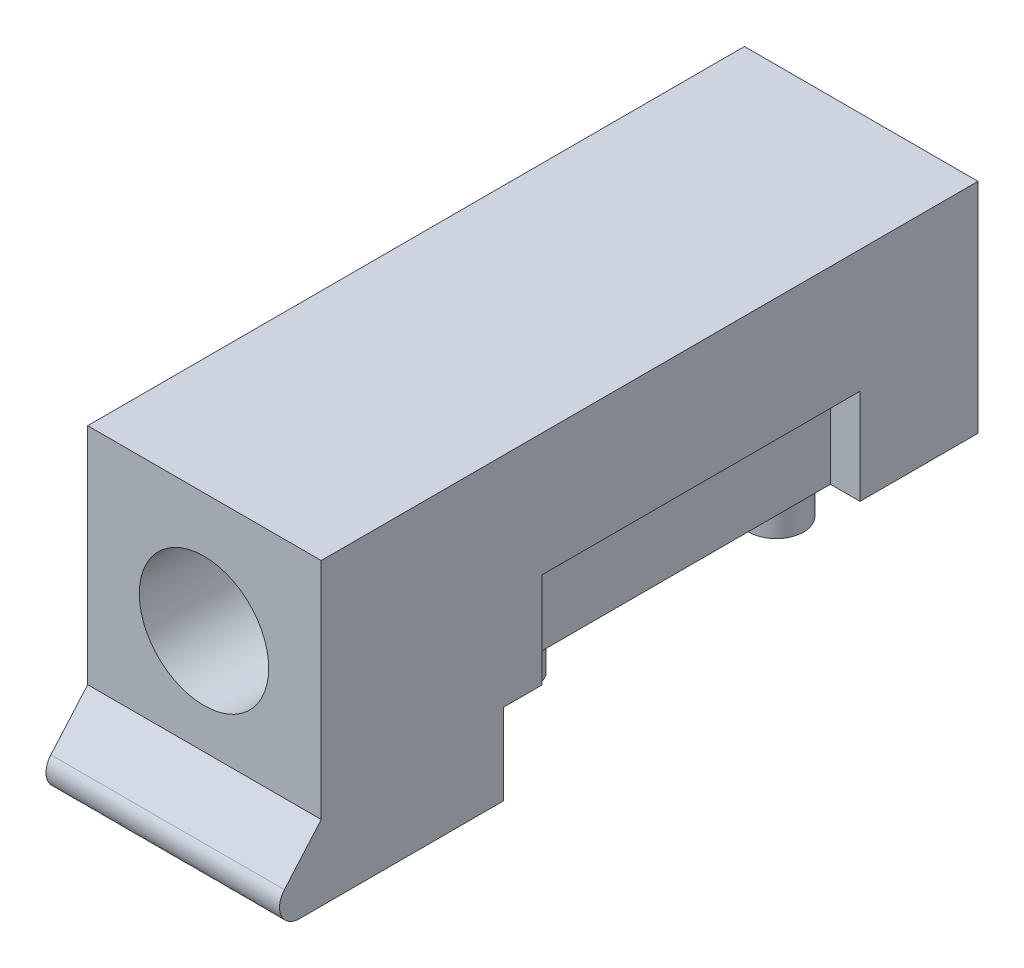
ISO-10303-21;
HEADER;
FILE_DESCRIPTION(('STEP AP214'),'2;1');
FILE_NAME('part.step','',(''),(''),'','','');
FILE_SCHEMA(('AUTOMOTIVE_DESIGN { 1 0 10303 214 1 1 1 1 }'));
ENDSEC;
DATA;
#1=APPLICATION_CONTEXT('core data for automotive mechanical design processes');
#2=APPLICATION_PROTOCOL_DEFINITION('international standard','automotive_design',2000,#1);
#3=PRODUCT_CONTEXT('',#1,'mechanical');
#4=PRODUCT('Part','Part','',(#3));
#5=PRODUCT_RELATED_PRODUCT_CATEGORY('part','',(#4));
#6=PRODUCT_DEFINITION_FORMATION('','',#4);
#7=PRODUCT_DEFINITION_CONTEXT('part definition',#1,'design');
#8=PRODUCT_DEFINITION('design','',#6,#7);
#9=PRODUCT_DEFINITION_SHAPE('','',#8);
#10=(LENGTH_UNIT() NAMED_UNIT(*) SI_UNIT(.MILLI.,.METRE.));
#11=(NAMED_UNIT(*) PLANE_ANGLE_UNIT() SI_UNIT($,.RADIAN.));
#12=(NAMED_UNIT(*) SI_UNIT($,.STERADIAN.) SOLID_ANGLE_UNIT());
#13=UNCERTAINTY_MEASURE_WITH_UNIT(LENGTH_MEASURE(1.E-05),#10,'distance_accuracy_value','');
#14=(GEOMETRIC_REPRESENTATION_CONTEXT(3) GLOBAL_UNCERTAINTY_ASSIGNED_CONTEXT((#13)) GLOBAL_UNIT_ASSIGNED_CONTEXT((#10,
#11,#12)) REPRESENTATION_CONTEXT('',''));
#15=CARTESIAN_POINT('',(0.,0.,0.));
#16=DIRECTION('',(0.,0.,1.));
#17=DIRECTION('',(1.,0.,0.));
#18=AXIS2_PLACEMENT_3D('',#15,#16,#17);
#19=CARTESIAN_POINT('',(-5.518,0.,-62.0626));
#20=DIRECTION('',(0.,1.,0.));
#21=DIRECTION('',(0.,0.,1.));
#22=AXIS2_PLACEMENT_3D('',#19,#20,#21);
#23=PLANE('',#22);
#24=CARTESIAN_POINT('',(0.,0.,-51.13));
#25=DIRECTION('',(0.,-1.,0.));
#26=DIRECTION('',(0.,0.,-1.));
#27=AXIS2_PLACEMENT_3D('',#24,#25,#26);
#28=CIRCLE('',#27,1.);
#29=CARTESIAN_POINT('',(0.,0.,-52.13));
#30=VERTEX_POINT('',#29);
#31=EDGE_CURVE('E641',#30,#30,#28,.T.);
#32=ORIENTED_EDGE('',*,*,#31,.F.);
#33=EDGE_LOOP('',(#32));
#34=FACE_BOUND('',#33,.T.);
#35=CARTESIAN_POINT('',(0.0200000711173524,0.,-45.5));
#36=DIRECTION('',(0.,1.,0.));
#37=DIRECTION('',(0.,0.,1.));
#38=AXIS2_PLACEMENT_3D('',#35,#36,#37);
#39=CIRCLE('',#38,1.25);
#40=CARTESIAN_POINT('',(0.0200000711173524,0.,-44.25));
#41=VERTEX_POINT('',#40);
#42=EDGE_CURVE('E39',#41,#41,#39,.F.);
#43=ORIENTED_EDGE('',*,*,#42,.F.);
#44=EDGE_LOOP('',(#43));
#45=FACE_BOUND('',#44,.T.);
#46=DIRECTION('',(1.,0.,0.));
#47=VECTOR('',#46,1.);
#48=CARTESIAN_POINT('',(-4.63,0.,-41.75));
#49=LINE('',#48,#47);
#50=CARTESIAN_POINT('',(-5.305,0.,-41.75));
#51=VERTEX_POINT('',#50);
#52=CARTESIAN_POINT('',(-3.955,0.,-41.75));
#53=VERTEX_POINT('',#52);
#54=EDGE_CURVE('E272',#51,#53,#49,.T.);
#55=ORIENTED_EDGE('',*,*,#54,.T.);
#56=DIRECTION('',(0.,0.,1.));
#57=VECTOR('',#56,1.);
#58=CARTESIAN_POINT('',(-3.955,0.,-50.815));
#59=LINE('',#58,#57);
#60=CARTESIAN_POINT('',(-3.955,0.,-56.25));
#61=VERTEX_POINT('',#60);
#62=EDGE_CURVE('E242',#61,#53,#59,.T.);
#63=ORIENTED_EDGE('',*,*,#62,.F.);
#64=DIRECTION('',(1.,0.,0.));
#65=VECTOR('',#64,1.);
#66=CARTESIAN_POINT('',(-4.63,0.,-56.25));
#67=LINE('',#66,#65);
#68=CARTESIAN_POINT('',(-5.305,0.,-56.25));
#69=VERTEX_POINT('',#68);
#70=EDGE_CURVE('E351',#61,#69,#67,.F.);
#71=ORIENTED_EDGE('',*,*,#70,.T.);
#72=DIRECTION('',(0.,0.,1.));
#73=VECTOR('',#72,1.);
#74=CARTESIAN_POINT('',(-5.305,0.,-50.815));
#75=LINE('',#74,#73);
#76=CARTESIAN_POINT('',(-5.305,0.,-61.63));
#77=VERTEX_POINT('',#76);
#78=EDGE_CURVE('E335',#77,#69,#75,.T.);
#79=ORIENTED_EDGE('',*,*,#78,.F.);
#80=DIRECTION('',(-1.,0.,0.));
#81=VECTOR('',#80,1.);
#82=CARTESIAN_POINT('',(0.0200000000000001,0.,-61.63));
#83=LINE('',#82,#81);
#84=CARTESIAN_POINT('',(5.345,0.,-61.63));
#85=VERTEX_POINT('',#84);
#86=EDGE_CURVE('E232',#85,#77,#83,.T.);
#87=ORIENTED_EDGE('',*,*,#86,.F.);
#88=DIRECTION('',(0.,0.,-1.));
#89=VECTOR('',#88,1.);
#90=CARTESIAN_POINT('',(5.345,0.,-45.705));
#91=LINE('',#90,#89);
#92=CARTESIAN_POINT('',(5.345,0.,-56.25));
#93=VERTEX_POINT('',#92);
#94=EDGE_CURVE('E55',#85,#93,#91,.F.);
#95=ORIENTED_EDGE('',*,*,#94,.T.);
#96=DIRECTION('',(1.,0.,0.));
#97=VECTOR('',#96,1.);
#98=CARTESIAN_POINT('',(4.67,0.,-56.25));
#99=LINE('',#98,#97);
#100=CARTESIAN_POINT('',(3.995,0.,-56.25));
#101=VERTEX_POINT('',#100);
#102=EDGE_CURVE('E185',#93,#101,#99,.F.);
#103=ORIENTED_EDGE('',*,*,#102,.T.);
#104=DIRECTION('',(0.,0.,-1.));
#105=VECTOR('',#104,1.);
#106=CARTESIAN_POINT('',(3.995,0.,-50.815));
#107=LINE('',#106,#105);
#108=CARTESIAN_POINT('',(3.995,0.,-41.75));
#109=VERTEX_POINT('',#108);
#110=EDGE_CURVE('E192',#109,#101,#107,.T.);
#111=ORIENTED_EDGE('',*,*,#110,.F.);
#112=DIRECTION('',(-1.,0.,0.));
#113=VECTOR('',#112,1.);
#114=CARTESIAN_POINT('',(0.0199999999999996,0.,-41.75));
#115=LINE('',#114,#113);
#116=CARTESIAN_POINT('',(5.345,0.,-41.75));
#117=VERTEX_POINT('',#116);
#118=EDGE_CURVE('E189',#117,#109,#115,.T.);
#119=ORIENTED_EDGE('',*,*,#118,.F.);
#120=DIRECTION('',(0.,0.,-1.));
#121=VECTOR('',#120,1.);
#122=CARTESIAN_POINT('',(5.345,0.,-45.705));
#123=LINE('',#122,#121);
#124=CARTESIAN_POINT('',(5.345,0.,-40.));
#125=VERTEX_POINT('',#124);
#126=EDGE_CURVE('E175',#117,#125,#123,.F.);
#127=ORIENTED_EDGE('',*,*,#126,.T.);
#128=DIRECTION('',(1.,0.,0.));
#129=VECTOR('',#128,1.);
#130=CARTESIAN_POINT('',(0.0199999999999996,0.,-40.));
#131=LINE('',#130,#129);
#132=CARTESIAN_POINT('',(-5.305,0.,-40.));
#133=VERTEX_POINT('',#132);
#134=EDGE_CURVE('E183',#133,#125,#131,.T.);
#135=ORIENTED_EDGE('',*,*,#134,.F.);
#136=DIRECTION('',(0.,0.,1.));
#137=VECTOR('',#136,1.);
#138=CARTESIAN_POINT('',(-5.305,0.,-50.815));
#139=LINE('',#138,#137);
#140=EDGE_CURVE('E186',#51,#133,#139,.T.);
#141=ORIENTED_EDGE('',*,*,#140,.F.);
#142=EDGE_LOOP('',(#55,#63,#71,#79,#87,#95,#103,#111,#119,#127,#135,#141));
#143=FACE_BOUND('',#142,.T.);
#144=CARTESIAN_POINT('',(0.0200000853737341,0.,-57.75));
#145=DIRECTION('',(0.,1.,0.));
#146=DIRECTION('',(0.,0.,1.));
#147=AXIS2_PLACEMENT_3D('',#144,#145,#146);
#148=CIRCLE('',#147,1.25);
#149=CARTESIAN_POINT('',(0.0200000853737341,0.,-56.5));
#150=VERTEX_POINT('',#149);
#151=EDGE_CURVE('E11',#150,#150,#148,.F.);
#152=ORIENTED_EDGE('',*,*,#151,.F.);
#153=EDGE_LOOP('',(#152));
#154=FACE_BOUND('',#153,.T.);
#155=ADVANCED_FACE('F30',(#34,#45,#143,#154),#23,.F.);
#156=CARTESIAN_POINT('',(-5.351126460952,4.35,-41.46));
#157=DIRECTION('',(0.,1.,0.));
#158=DIRECTION('',(1.,0.,0.));
#159=AXIS2_PLACEMENT_3D('',#156,#157,#158);
#160=PLANE('',#159);
#161=DIRECTION('',(0.,0.,1.));
#162=VECTOR('',#161,1.);
#163=CARTESIAN_POINT('',(-3.955,4.35,-49.));
#164=LINE('',#163,#162);
#165=CARTESIAN_POINT('',(-3.955,4.35,-56.25));
#166=VERTEX_POINT('',#165);
#167=CARTESIAN_POINT('',(-3.955,4.35,-41.75));
#168=VERTEX_POINT('',#167);
#169=EDGE_CURVE('E373',#166,#168,#164,.T.);
#170=ORIENTED_EDGE('',*,*,#169,.T.);
#171=DIRECTION('',(-1.,0.,0.));
#172=VECTOR('',#171,1.);
#173=CARTESIAN_POINT('',(-4.63,4.35,-41.75));
#174=LINE('',#173,#172);
#175=CARTESIAN_POINT('',(-5.305,4.35,-41.75));
#176=VERTEX_POINT('',#175);
#177=EDGE_CURVE('E469',#168,#176,#174,.T.);
#178=ORIENTED_EDGE('',*,*,#177,.T.);
#179=DIRECTION('',(0.,0.,-1.));
#180=VECTOR('',#179,1.);
#181=CARTESIAN_POINT('',(-5.305,4.35,-45.705));
#182=LINE('',#181,#180);
#183=CARTESIAN_POINT('',(-5.305,4.35,-56.25));
#184=VERTEX_POINT('',#183);
#185=EDGE_CURVE('E362',#176,#184,#182,.T.);
#186=ORIENTED_EDGE('',*,*,#185,.T.);
#187=DIRECTION('',(-1.,0.,0.));
#188=VECTOR('',#187,1.);
#189=CARTESIAN_POINT('',(-4.63,4.35,-56.25));
#190=LINE('',#189,#188);
#191=EDGE_CURVE('E330',#184,#166,#190,.F.);
#192=ORIENTED_EDGE('',*,*,#191,.T.);
#193=EDGE_LOOP('',(#170,#178,#186,#192));
#194=FACE_BOUND('',#193,.T.);
#195=ADVANCED_FACE('F265',(#194),#160,.F.);
#196=CARTESIAN_POINT('',(-5.351126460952,-0.087,-56.25));
#197=DIRECTION('',(0.,0.,1.));
#198=DIRECTION('',(1.,0.,0.));
#199=AXIS2_PLACEMENT_3D('',#196,#197,#198);
#200=PLANE('',#199);
#201=DIRECTION('',(0.,1.,0.));
#202=VECTOR('',#201,1.);
#203=CARTESIAN_POINT('',(-3.955,2.175,-56.25));
#204=LINE('',#203,#202);
#205=EDGE_CURVE('E375',#61,#166,#204,.T.);
#206=ORIENTED_EDGE('',*,*,#205,.T.);
#207=ORIENTED_EDGE('',*,*,#191,.F.);
#208=DIRECTION('',(0.,-1.,0.));
#209=VECTOR('',#208,1.);
#210=CARTESIAN_POINT('',(-5.305,5.5,-56.25));
#211=LINE('',#210,#209);
#212=EDGE_CURVE('E359',#184,#69,#211,.T.);
#213=ORIENTED_EDGE('',*,*,#212,.T.);
#214=ORIENTED_EDGE('',*,*,#70,.F.);
#215=EDGE_LOOP('',(#206,#207,#213,#214));
#216=FACE_BOUND('',#215,.T.);
#217=ADVANCED_FACE('F360',(#216),#200,.T.);
#218=CARTESIAN_POINT('',(-3.908873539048,4.437,-41.75));
#219=DIRECTION('',(0.,0.,1.));
#220=DIRECTION('',(-1.,0.,0.));
#221=AXIS2_PLACEMENT_3D('',#218,#219,#220);
#222=PLANE('',#221);
#223=DIRECTION('',(0.,-1.,0.));
#224=VECTOR('',#223,1.);
#225=CARTESIAN_POINT('',(-3.955,2.175,-41.75));
#226=LINE('',#225,#224);
#227=EDGE_CURVE('E365',#168,#53,#226,.T.);
#228=ORIENTED_EDGE('',*,*,#227,.T.);
#229=ORIENTED_EDGE('',*,*,#54,.F.);
#230=DIRECTION('',(0.,1.,0.));
#231=VECTOR('',#230,1.);
#232=CARTESIAN_POINT('',(-5.305,5.5,-41.75));
#233=LINE('',#232,#231);
#234=EDGE_CURVE('E222',#51,#176,#233,.T.);
#235=ORIENTED_EDGE('',*,*,#234,.T.);
#236=ORIENTED_EDGE('',*,*,#177,.F.);
#237=EDGE_LOOP('',(#228,#229,#235,#236));
#238=FACE_BOUND('',#237,.T.);
#239=ADVANCED_FACE('F441',(#238),#222,.F.);
#240=CARTESIAN_POINT('',(5.558,-3.698818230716,-30.72610626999));
#241=CARTESIAN_POINT('',(1.866,-3.698818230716,-30.72610626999));
#242=CARTESIAN_POINT('',(-1.826,-3.698818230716,-30.72610626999));
#243=CARTESIAN_POINT('',(-5.518,-3.698818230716,-30.72610626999));
#244=CARTESIAN_POINT('',(5.558,-3.703407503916,-30.63664072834));
#245=CARTESIAN_POINT('',(1.866,-3.703407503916,-30.63664072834));
#246=CARTESIAN_POINT('',(-1.826,-3.703407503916,-30.63664072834));
#247=CARTESIAN_POINT('',(-5.518,-3.703407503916,-30.63664072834));
#248=CARTESIAN_POINT('',(5.558,-3.685670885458,-30.45634286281));
#249=CARTESIAN_POINT('',(1.866,-3.685670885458,-30.45634286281));
#250=CARTESIAN_POINT('',(-1.826,-3.685670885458,-30.45634286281));
#251=CARTESIAN_POINT('',(-5.518,-3.685670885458,-30.45634286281));
#252=CARTESIAN_POINT('',(5.558,-3.580677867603,-30.20568047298));
#253=CARTESIAN_POINT('',(1.866,-3.580677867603,-30.20568047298));
#254=CARTESIAN_POINT('',(-1.826,-3.580677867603,-30.20568047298));
#255=CARTESIAN_POINT('',(-5.518,-3.580677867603,-30.20568047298));
#256=CARTESIAN_POINT('',(5.558,-3.40658871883,-29.99700194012));
#257=CARTESIAN_POINT('',(1.866,-3.40658871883,-29.99700194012));
#258=CARTESIAN_POINT('',(-1.826,-3.40658871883,-29.99700194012));
#259=CARTESIAN_POINT('',(-5.518,-3.40658871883,-29.99700194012));
#260=CARTESIAN_POINT('',(5.558,-3.178811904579,-29.84877313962));
#261=CARTESIAN_POINT('',(1.866,-3.178811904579,-29.84877313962));
#262=CARTESIAN_POINT('',(-1.826,-3.178811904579,-29.84877313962));
#263=CARTESIAN_POINT('',(-5.518,-3.178811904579,-29.84877313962));
#264=CARTESIAN_POINT('',(5.558,-2.917507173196,-29.77411463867));
#265=CARTESIAN_POINT('',(1.866,-2.917507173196,-29.77411463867));
#266=CARTESIAN_POINT('',(-1.826,-2.917507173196,-29.77411463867));
#267=CARTESIAN_POINT('',(-5.518,-2.917507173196,-29.77411463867));
#268=CARTESIAN_POINT('',(5.558,-2.645802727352,-29.77963332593));
#269=CARTESIAN_POINT('',(1.866,-2.645802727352,-29.77963332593));
#270=CARTESIAN_POINT('',(-1.826,-2.645802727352,-29.77963332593));
#271=CARTESIAN_POINT('',(-5.518,-2.645802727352,-29.77963332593));
#272=CARTESIAN_POINT('',(5.558,-2.387743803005,-29.86484341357));
#273=CARTESIAN_POINT('',(1.866,-2.387743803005,-29.86484341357));
#274=CARTESIAN_POINT('',(-1.826,-2.387743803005,-29.86484341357));
#275=CARTESIAN_POINT('',(-5.518,-2.387743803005,-29.86484341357));
#276=CARTESIAN_POINT('',(5.558,-2.240035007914,-29.96974346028));
#277=CARTESIAN_POINT('',(1.866,-2.240035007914,-29.96974346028));
#278=CARTESIAN_POINT('',(-1.826,-2.240035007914,-29.96974346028));
#279=CARTESIAN_POINT('',(-5.518,-2.240035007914,-29.96974346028));
#280=CARTESIAN_POINT('',(5.558,-2.17552534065,-30.03190170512));
#281=CARTESIAN_POINT('',(1.866,-2.17552534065,-30.03190170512));
#282=CARTESIAN_POINT('',(-1.826,-2.17552534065,-30.03190170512));
#283=CARTESIAN_POINT('',(-5.518,-2.17552534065,-30.03190170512));
#284=B_SPLINE_SURFACE_WITH_KNOTS('',3,3,((#240,#241,#242,#243),(#244,#245,#246,#247),(#248,#249,
#250,#251),(#252,#253,#254,#255),(#256,#257,#258,#259),(#260,#261,#262,#263),(#264,#265,#266,
#267),(#268,#269,#270,#271),(#272,#273,#274,#275),(#276,#277,#278,#279),(#280,#281,#282,#283)),
.UNSPECIFIED.,.F.,.F.,.F.,(4,1,1,1,1,1,1,1,4),(4,4),(4.661137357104,4.959747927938,
5.258358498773,5.556969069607,5.855579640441,6.154190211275,6.452800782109,6.751411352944,
7.050021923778),(0.,11.076),.UNSPECIFIED.);
#285=CARTESIAN_POINT('',(5.558,-2.20955085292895,-30.0007659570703));
#286=CARTESIAN_POINT('',(1.866,-2.20955085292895,-30.0007659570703));
#287=CARTESIAN_POINT('',(-1.826,-2.20955085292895,-30.0007659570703));
#288=CARTESIAN_POINT('',(-5.518,-2.20955085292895,-30.0007659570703));
#289=B_SPLINE_CURVE_WITH_KNOTS('',3,(#285,#286,#287,#288),.UNSPECIFIED.,.F.,.F.,(4,4),(0.,
11.076),.UNSPECIFIED.);
#290=CARTESIAN_POINT('',(5.345,-2.20954886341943,-30.0007636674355));
#291=VERTEX_POINT('',#290);
#292=CARTESIAN_POINT('',(-5.305,-2.20954886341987,-30.000763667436));
#293=VERTEX_POINT('',#292);
#294=EDGE_CURVE('E141',#291,#293,#289,.T.);
#295=CARTESIAN_POINT('',(-5.305,-2.20955085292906,-30.0007659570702));
#296=CARTESIAN_POINT('',(-5.305,-2.22864470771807,-29.9841754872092));
#297=CARTESIAN_POINT('',(-5.305,-2.2484373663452,-29.9683911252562));
#298=CARTESIAN_POINT('',(-5.305,-2.28927631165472,-29.9385380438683));
#299=CARTESIAN_POINT('',(-5.305,-2.31032257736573,-29.924469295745));
#300=CARTESIAN_POINT('',(-5.305,-2.35357081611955,-29.8981226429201));
#301=CARTESIAN_POINT('',(-5.305,-2.3757751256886,-29.8858485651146));
#302=CARTESIAN_POINT('',(-5.305,-2.42113949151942,-29.8632346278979));
#303=CARTESIAN_POINT('',(-5.305,-2.44429950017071,-29.8528946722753));
#304=CARTESIAN_POINT('',(-5.305,-2.5149818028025,-29.8248429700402));
#305=CARTESIAN_POINT('',(-5.305,-2.56371636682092,-29.8100933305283));
#306=CARTESIAN_POINT('',(-5.305,-2.66283289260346,-29.7890814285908));
#307=CARTESIAN_POINT('',(-5.305,-2.71320884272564,-29.7827911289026));
#308=CARTESIAN_POINT('',(-5.305,-2.77577573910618,-29.7802626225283));
#309=CARTESIAN_POINT('',(-5.305,-2.78788468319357,-29.780018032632));
#310=CARTESIAN_POINT('',(-5.305,-2.85046925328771,-29.7800192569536));
#311=CARTESIAN_POINT('',(-5.305,-2.90104911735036,-29.7842688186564));
#312=CARTESIAN_POINT('',(-5.305,-2.97580043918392,-29.7969783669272));
#313=CARTESIAN_POINT('',(-5.305,-3.00057006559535,-29.8022844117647));
#314=CARTESIAN_POINT('',(-5.305,-3.04959531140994,-29.8149529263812));
#315=CARTESIAN_POINT('',(-5.305,-3.07385066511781,-29.8223164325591));
#316=CARTESIAN_POINT('',(-5.305,-3.14542713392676,-29.8474068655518));
#317=CARTESIAN_POINT('',(-5.305,-3.19172441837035,-29.8681619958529));
#318=CARTESIAN_POINT('',(-5.305,-3.2802421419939,-29.9171657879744));
#319=CARTESIAN_POINT('',(-5.305,-3.32245542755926,-29.9454272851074));
#320=CARTESIAN_POINT('',(-5.305,-3.40155107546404,-30.0086693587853));
#321=CARTESIAN_POINT('',(-5.305,-3.43843056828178,-30.0436535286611));
#322=CARTESIAN_POINT('',(-5.305,-3.50574845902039,-30.1192421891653));
#323=CARTESIAN_POINT('',(-5.305,-3.53619779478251,-30.1598369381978));
#324=CARTESIAN_POINT('',(-5.305,-3.589843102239,-30.2455974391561));
#325=CARTESIAN_POINT('',(-5.305,-3.61303428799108,-30.2907661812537));
#326=CARTESIAN_POINT('',(-5.305,-3.65153143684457,-30.3843377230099));
#327=CARTESIAN_POINT('',(-5.305,-3.66684156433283,-30.4327387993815));
#328=CARTESIAN_POINT('',(-5.305,-3.68528292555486,-30.5145326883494));
#329=CARTESIAN_POINT('',(-5.305,-3.69078744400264,-30.5474093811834));
#330=CARTESIAN_POINT('',(-5.305,-3.69813347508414,-30.613520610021));
#331=CARTESIAN_POINT('',(-5.305,-3.69998039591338,-30.646754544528));
#332=CARTESIAN_POINT('',(-5.305,-3.69999393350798,-30.680000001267));
#333=B_SPLINE_CURVE_WITH_KNOTS('',3,(#295,#296,#297,#298,#299,#300,#301,#302,#303,#304,#305,
#306,#307,#308,#309,#310,#311,#312,#313,#314,#315,#316,#317,#318,#319,#320,#321,#322,#323,#324,
#325,#326,#327,#328,#329,#330,#331,#332),.UNSPECIFIED.,.F.,.F.,(4,2,2,2,2,2,2,2,2,2,2,2,2,2,2,2,
2,2,4),(0.,0.0758594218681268,0.151717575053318,0.227735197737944,0.303749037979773,
0.455742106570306,0.607230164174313,0.643565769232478,0.794930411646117,0.87085735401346,
0.946822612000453,1.0982551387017,1.24994828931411,1.40172274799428,1.55323691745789,
1.70485078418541,1.85638445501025,1.95619626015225,2.05586037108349),.UNSPECIFIED.);
#334=CARTESIAN_POINT('',(-5.305,-3.69999696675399,-30.6800000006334));
#335=VERTEX_POINT('',#334);
#336=EDGE_CURVE('E247',#293,#335,#333,.T.);
#337=CARTESIAN_POINT('',(-5.518,-3.69999393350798,-30.6800000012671));
#338=CARTESIAN_POINT('',(-1.826,-3.69999393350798,-30.6800000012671));
#339=CARTESIAN_POINT('',(1.866,-3.69999393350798,-30.6800000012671));
#340=CARTESIAN_POINT('',(5.558,-3.69999393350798,-30.6800000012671));
#341=B_SPLINE_CURVE_WITH_KNOTS('',3,(#337,#338,#339,#340),.UNSPECIFIED.,.F.,.F.,(4,4),(0.,
11.076),.UNSPECIFIED.);
#342=CARTESIAN_POINT('',(5.345,-3.69999696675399,-30.6800000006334));
#343=VERTEX_POINT('',#342);
#344=EDGE_CURVE('E393',#335,#343,#341,.T.);
#345=CARTESIAN_POINT('',(5.345,-2.20955085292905,-30.0007659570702));
#346=CARTESIAN_POINT('',(5.345,-2.22864470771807,-29.9841754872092));
#347=CARTESIAN_POINT('',(5.345,-2.24843736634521,-29.9683911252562));
#348=CARTESIAN_POINT('',(5.345,-2.28927631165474,-29.9385380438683));
#349=CARTESIAN_POINT('',(5.345,-2.31032257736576,-29.924469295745));
#350=CARTESIAN_POINT('',(5.345,-2.3535708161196,-29.89812264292));
#351=CARTESIAN_POINT('',(5.345,-2.37577512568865,-29.8858485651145));
#352=CARTESIAN_POINT('',(5.345,-2.42113949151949,-29.8632346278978));
#353=CARTESIAN_POINT('',(5.345,-2.44429950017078,-29.8528946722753));
#354=CARTESIAN_POINT('',(5.345,-2.5149818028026,-29.8248429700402));
#355=CARTESIAN_POINT('',(5.345,-2.56371636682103,-29.8100933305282));
#356=CARTESIAN_POINT('',(5.345,-2.66283289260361,-29.7890814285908));
#357=CARTESIAN_POINT('',(5.345,-2.7132088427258,-29.7827911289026));
#358=CARTESIAN_POINT('',(5.345,-2.7757757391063,-29.7802626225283));
#359=CARTESIAN_POINT('',(5.345,-2.78788468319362,-29.780018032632));
#360=CARTESIAN_POINT('',(5.345,-2.85046925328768,-29.7800192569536));
#361=CARTESIAN_POINT('',(5.345,-2.90104911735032,-29.7842688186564));
#362=CARTESIAN_POINT('',(5.345,-2.97580043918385,-29.7969783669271));
#363=CARTESIAN_POINT('',(5.345,-3.00057006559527,-29.8022844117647));
#364=CARTESIAN_POINT('',(5.345,-3.04959531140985,-29.8149529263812));
#365=CARTESIAN_POINT('',(5.345,-3.07385066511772,-29.8223164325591));
#366=CARTESIAN_POINT('',(5.345,-3.14542713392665,-29.8474068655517));
#367=CARTESIAN_POINT('',(5.345,-3.19172441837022,-29.8681619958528));
#368=CARTESIAN_POINT('',(5.345,-3.28024214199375,-29.9171657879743));
#369=CARTESIAN_POINT('',(5.345,-3.32245542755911,-29.9454272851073));
#370=CARTESIAN_POINT('',(5.345,-3.40155107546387,-30.0086693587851));
#371=CARTESIAN_POINT('',(5.345,-3.43843056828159,-30.0436535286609));
#372=CARTESIAN_POINT('',(5.345,-3.50574845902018,-30.1192421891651));
#373=CARTESIAN_POINT('',(5.345,-3.5361977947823,-30.1598369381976));
#374=CARTESIAN_POINT('',(5.345,-3.58984310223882,-30.2455974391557));
#375=CARTESIAN_POINT('',(5.345,-3.61303428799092,-30.2907661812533));
#376=CARTESIAN_POINT('',(5.345,-3.65153143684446,-30.3843377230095));
#377=CARTESIAN_POINT('',(5.345,-3.66684156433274,-30.4327387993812));
#378=CARTESIAN_POINT('',(5.345,-3.68528292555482,-30.5145326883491));
#379=CARTESIAN_POINT('',(5.345,-3.69078744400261,-30.5474093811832));
#380=CARTESIAN_POINT('',(5.345,-3.69813347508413,-30.6135206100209));
#381=CARTESIAN_POINT('',(5.345,-3.69998039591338,-30.646754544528));
#382=CARTESIAN_POINT('',(5.345,-3.69999393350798,-30.680000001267));
#383=B_SPLINE_CURVE_WITH_KNOTS('',3,(#345,#346,#347,#348,#349,#350,#351,#352,#353,#354,#355,
#356,#357,#358,#359,#360,#361,#362,#363,#364,#365,#366,#367,#368,#369,#370,#371,#372,#373,#374,
#375,#376,#377,#378,#379,#380,#381,#382),.UNSPECIFIED.,.F.,.F.,(4,2,2,2,2,2,2,2,2,2,2,2,2,2,2,2,
2,2,4),(0.,0.0758594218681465,0.151717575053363,0.227735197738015,0.303749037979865,
0.455742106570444,0.607230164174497,0.643565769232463,0.794930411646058,0.870857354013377,
0.946822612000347,1.09825513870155,1.24994828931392,1.40172274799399,1.5532369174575,
1.70485078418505,1.85638445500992,1.95619626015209,2.0558603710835),.UNSPECIFIED.);
#384=EDGE_CURVE('E385',#291,#343,#383,.T.);
#385=ORIENTED_EDGE('',*,*,#294,.T.);
#386=ORIENTED_EDGE('',*,*,#336,.T.);
#387=ORIENTED_EDGE('',*,*,#344,.T.);
#388=ORIENTED_EDGE('',*,*,#384,.F.);
#389=EDGE_LOOP('',(#385,#386,#387,#388));
#390=FACE_BOUND('',#389,.T.);
#391=ADVANCED_FACE('F434',(#390),#284,.T.);
#392=CARTESIAN_POINT('',(-3.955,4.437,-56.54));
#393=DIRECTION('',(1.,0.,0.));
#394=DIRECTION('',(0.,0.,1.));
#395=AXIS2_PLACEMENT_3D('',#392,#393,#394);
#396=PLANE('',#395);
#397=ORIENTED_EDGE('',*,*,#169,.F.);
#398=ORIENTED_EDGE('',*,*,#205,.F.);
#399=ORIENTED_EDGE('',*,*,#62,.T.);
#400=ORIENTED_EDGE('',*,*,#227,.F.);
#401=EDGE_LOOP('',(#397,#398,#399,#400));
#402=FACE_BOUND('',#401,.T.);
#403=ADVANCED_FACE('F440',(#402),#396,.F.);
#404=CARTESIAN_POINT('',(-5.305,15.068,-62.267));
#405=DIRECTION('',(1.,0.,0.));
#406=DIRECTION('',(0.,0.,1.));
#407=AXIS2_PLACEMENT_3D('',#404,#405,#406);
#408=PLANE('',#407);
#409=DIRECTION('',(0.,-1.,0.));
#410=VECTOR('',#409,1.);
#411=CARTESIAN_POINT('',(-5.305,5.49999999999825,-31.68));
#412=LINE('',#411,#410);
#413=CARTESIAN_POINT('',(-5.305,-0.277803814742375,-31.679999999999));
#414=VERTEX_POINT('',#413);
#415=CARTESIAN_POINT('',(-5.305,9.95,-31.68));
#416=VERTEX_POINT('',#415);
#417=EDGE_CURVE('E152',#414,#416,#412,.F.);
#418=ORIENTED_EDGE('',*,*,#417,.T.);
#419=DIRECTION('',(0.,0.,1.));
#420=VECTOR('',#419,1.);
#421=CARTESIAN_POINT('',(-5.305,9.95,-68.2273435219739));
#422=LINE('',#421,#420);
#423=CARTESIAN_POINT('',(-5.305,9.95,-61.63));
#424=VERTEX_POINT('',#423);
#425=EDGE_CURVE('E327',#424,#416,#422,.T.);
#426=ORIENTED_EDGE('',*,*,#425,.F.);
#427=DIRECTION('',(0.,-1.,0.));
#428=VECTOR('',#427,1.);
#429=CARTESIAN_POINT('',(-5.305,7.35,-61.63));
#430=LINE('',#429,#428);
#431=EDGE_CURVE('E193',#424,#77,#430,.T.);
#432=ORIENTED_EDGE('',*,*,#431,.T.);
#433=ORIENTED_EDGE('',*,*,#78,.T.);
#434=ORIENTED_EDGE('',*,*,#212,.F.);
#435=ORIENTED_EDGE('',*,*,#185,.F.);
#436=ORIENTED_EDGE('',*,*,#234,.F.);
#437=ORIENTED_EDGE('',*,*,#140,.T.);
#438=DIRECTION('',(0.,-1.,0.));
#439=VECTOR('',#438,1.);
#440=CARTESIAN_POINT('',(-5.305,-1.85,-40.));
#441=LINE('',#440,#439);
#442=CARTESIAN_POINT('',(-5.305,-3.7,-40.));
#443=VERTEX_POINT('',#442);
#444=EDGE_CURVE('E170',#133,#443,#441,.T.);
#445=ORIENTED_EDGE('',*,*,#444,.T.);
#446=DIRECTION('',(0.,0.,1.));
#447=VECTOR('',#446,1.);
#448=CARTESIAN_POINT('',(-5.305,-3.7,-35.34));
#449=LINE('',#448,#447);
#450=EDGE_CURVE('E169',#443,#335,#449,.T.);
#451=ORIENTED_EDGE('',*,*,#450,.T.);
#452=ORIENTED_EDGE('',*,*,#336,.F.);
#453=DIRECTION('',(0.,-0.754709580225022,0.656059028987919));
#454=VECTOR('',#453,1.);
#455=CARTESIAN_POINT('',(-5.305,-1.24367534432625,-30.8403806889));
#456=LINE('',#455,#454);
#457=EDGE_CURVE('E153',#293,#414,#456,.F.);
#458=ORIENTED_EDGE('',*,*,#457,.T.);
#459=EDGE_LOOP('',(#418,#426,#432,#433,#434,#435,#436,#437,#445,#451,#452,#458));
#460=FACE_BOUND('',#459,.T.);
#461=ADVANCED_FACE('F347',(#460),#408,.F.);
#462=CARTESIAN_POINT('',(3.995,-0.087,-41.46));
#463=DIRECTION('',(1.,0.,0.));
#464=DIRECTION('',(0.,0.,-1.));
#465=AXIS2_PLACEMENT_3D('',#462,#463,#464);
#466=PLANE('',#465);
#467=DIRECTION('',(0.,0.,1.));
#468=VECTOR('',#467,1.);
#469=CARTESIAN_POINT('',(3.995,4.35,-49.));
#470=LINE('',#469,#468);
#471=CARTESIAN_POINT('',(3.995,4.35,-56.25));
#472=VERTEX_POINT('',#471);
#473=CARTESIAN_POINT('',(3.995,4.35,-41.75));
#474=VERTEX_POINT('',#473);
#475=EDGE_CURVE('E204',#472,#474,#470,.T.);
#476=ORIENTED_EDGE('',*,*,#475,.T.);
#477=DIRECTION('',(0.,-1.,0.));
#478=VECTOR('',#477,1.);
#479=CARTESIAN_POINT('',(3.995,2.175,-41.75));
#480=LINE('',#479,#478);
#481=EDGE_CURVE('E203',#474,#109,#480,.T.);
#482=ORIENTED_EDGE('',*,*,#481,.T.);
#483=ORIENTED_EDGE('',*,*,#110,.T.);
#484=DIRECTION('',(0.,-1.,0.));
#485=VECTOR('',#484,1.);
#486=CARTESIAN_POINT('',(3.995,2.175,-56.25));
#487=LINE('',#486,#485);
#488=EDGE_CURVE('E218',#101,#472,#487,.F.);
#489=ORIENTED_EDGE('',*,*,#488,.T.);
#490=EDGE_LOOP('',(#476,#482,#483,#489));
#491=FACE_BOUND('',#490,.T.);
#492=ADVANCED_FACE('F515',(#491),#466,.T.);
#493=CARTESIAN_POINT('',(3.948873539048,4.35,-41.46));
#494=DIRECTION('',(0.,1.,0.));
#495=DIRECTION('',(1.,0.,0.));
#496=AXIS2_PLACEMENT_3D('',#493,#494,#495);
#497=PLANE('',#496);
#498=ORIENTED_EDGE('',*,*,#475,.F.);
#499=DIRECTION('',(-1.,0.,0.));
#500=VECTOR('',#499,1.);
#501=CARTESIAN_POINT('',(4.67,4.35,-56.25));
#502=LINE('',#501,#500);
#503=CARTESIAN_POINT('',(5.345,4.35,-56.25));
#504=VERTEX_POINT('',#503);
#505=EDGE_CURVE('E208',#472,#504,#502,.F.);
#506=ORIENTED_EDGE('',*,*,#505,.T.);
#507=DIRECTION('',(0.,0.,-1.));
#508=VECTOR('',#507,1.);
#509=CARTESIAN_POINT('',(5.345,4.35,-45.705));
#510=LINE('',#509,#508);
#511=CARTESIAN_POINT('',(5.345,4.35,-41.75));
#512=VERTEX_POINT('',#511);
#513=EDGE_CURVE('E197',#504,#512,#510,.F.);
#514=ORIENTED_EDGE('',*,*,#513,.T.);
#515=DIRECTION('',(-1.,0.,0.));
#516=VECTOR('',#515,1.);
#517=CARTESIAN_POINT('',(4.67,4.35,-41.75));
#518=LINE('',#517,#516);
#519=EDGE_CURVE('E200',#512,#474,#518,.T.);
#520=ORIENTED_EDGE('',*,*,#519,.T.);
#521=EDGE_LOOP('',(#498,#506,#514,#520));
#522=FACE_BOUND('',#521,.T.);
#523=ADVANCED_FACE('F511',(#522),#497,.F.);
#524=CARTESIAN_POINT('',(5.391126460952,4.437,-41.75));
#525=DIRECTION('',(0.,0.,1.));
#526=DIRECTION('',(-1.,0.,0.));
#527=AXIS2_PLACEMENT_3D('',#524,#525,#526);
#528=PLANE('',#527);
#529=ORIENTED_EDGE('',*,*,#481,.F.);
#530=ORIENTED_EDGE('',*,*,#519,.F.);
#531=DIRECTION('',(0.,1.,0.));
#532=VECTOR('',#531,1.);
#533=CARTESIAN_POINT('',(5.345,5.5,-41.75));
#534=LINE('',#533,#532);
#535=EDGE_CURVE('E180',#512,#117,#534,.F.);
#536=ORIENTED_EDGE('',*,*,#535,.T.);
#537=ORIENTED_EDGE('',*,*,#118,.T.);
#538=EDGE_LOOP('',(#529,#530,#536,#537));
#539=FACE_BOUND('',#538,.T.);
#540=ADVANCED_FACE('F519',(#539),#528,.F.);
#541=CARTESIAN_POINT('',(-5.518,0.074,-40.));
#542=DIRECTION('',(0.,0.,1.));
#543=DIRECTION('',(0.,-1.,0.));
#544=AXIS2_PLACEMENT_3D('',#541,#542,#543);
#545=PLANE('',#544);
#546=ORIENTED_EDGE('',*,*,#444,.F.);
#547=ORIENTED_EDGE('',*,*,#134,.T.);
#548=DIRECTION('',(0.,1.,0.));
#549=VECTOR('',#548,1.);
#550=CARTESIAN_POINT('',(5.345,5.5,-40.));
#551=LINE('',#550,#549);
#552=CARTESIAN_POINT('',(5.345,-3.7,-40.));
#553=VERTEX_POINT('',#552);
#554=EDGE_CURVE('E173',#125,#553,#551,.F.);
#555=ORIENTED_EDGE('',*,*,#554,.T.);
#556=DIRECTION('',(-1.,0.,0.));
#557=VECTOR('',#556,1.);
#558=CARTESIAN_POINT('',(0.0199999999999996,-3.7,-40.));
#559=LINE('',#558,#557);
#560=EDGE_CURVE('E166',#553,#443,#559,.T.);
#561=ORIENTED_EDGE('',*,*,#560,.T.);
#562=EDGE_LOOP('',(#546,#547,#555,#561));
#563=FACE_BOUND('',#562,.T.);
#564=ADVANCED_FACE('F408',(#563),#545,.F.);
#565=CARTESIAN_POINT('',(-5.518,-3.7,-40.1864));
#566=DIRECTION('',(0.,1.,0.));
#567=DIRECTION('',(0.,0.,1.));
#568=AXIS2_PLACEMENT_3D('',#565,#566,#567);
#569=PLANE('',#568);
#570=ORIENTED_EDGE('',*,*,#450,.F.);
#571=ORIENTED_EDGE('',*,*,#560,.F.);
#572=DIRECTION('',(0.,0.,-1.));
#573=VECTOR('',#572,1.);
#574=CARTESIAN_POINT('',(5.345,-3.7,-45.705));
#575=LINE('',#574,#573);
#576=EDGE_CURVE('E146',#553,#343,#575,.F.);
#577=ORIENTED_EDGE('',*,*,#576,.T.);
#578=ORIENTED_EDGE('',*,*,#344,.F.);
#579=EDGE_LOOP('',(#570,#571,#577,#578));
#580=FACE_BOUND('',#579,.T.);
#581=ADVANCED_FACE('F398',(#580),#569,.F.);
#582=CARTESIAN_POINT('',(5.558,-2.248181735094,-29.96717660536));
#583=DIRECTION('',(0.,0.656059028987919,0.754709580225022));
#584=DIRECTION('',(0.,0.754709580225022,-0.656059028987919));
#585=AXIS2_PLACEMENT_3D('',#582,#583,#584);
#586=PLANE('',#585);
#587=ORIENTED_EDGE('',*,*,#457,.F.);
#588=ORIENTED_EDGE('',*,*,#294,.F.);
#589=DIRECTION('',(0.,0.754709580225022,-0.656059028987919));
#590=VECTOR('',#589,1.);
#591=CARTESIAN_POINT('',(5.345,-2.248181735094,-29.96717660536));
#592=LINE('',#591,#590);
#593=CARTESIAN_POINT('',(5.345,-0.277803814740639,-31.6799999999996));
#594=VERTEX_POINT('',#593);
#595=EDGE_CURVE('E134',#291,#594,#592,.T.);
#596=ORIENTED_EDGE('',*,*,#595,.T.);
#597=DIRECTION('',(1.,0.,0.));
#598=VECTOR('',#597,1.);
#599=CARTESIAN_POINT('',(0.0199999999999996,-0.2778038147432,-31.68));
#600=LINE('',#599,#598);
#601=EDGE_CURVE('E138',#594,#414,#600,.F.);
#602=ORIENTED_EDGE('',*,*,#601,.T.);
#603=EDGE_LOOP('',(#587,#588,#596,#602));
#604=FACE_BOUND('',#603,.T.);
#605=ADVANCED_FACE('F137',(#604),#586,.T.);
#606=CARTESIAN_POINT('',(5.558,-0.5089159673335,-31.68));
#607=DIRECTION('',(0.,0.,1.));
#608=DIRECTION('',(0.,1.,0.));
#609=AXIS2_PLACEMENT_3D('',#606,#607,#608);
#610=PLANE('',#609);
#611=CARTESIAN_POINT('',(0.,4.5,-31.68));
#612=DIRECTION('',(0.,0.,1.));
#613=DIRECTION('',(1.,0.,0.));
#614=AXIS2_PLACEMENT_3D('',#611,#612,#613);
#615=CIRCLE('',#614,2.95);
#616=CARTESIAN_POINT('',(2.95,4.5,-31.68));
#617=VERTEX_POINT('',#616);
#618=EDGE_CURVE('E320',#617,#617,#615,.T.);
#619=ORIENTED_EDGE('',*,*,#618,.F.);
#620=EDGE_LOOP('',(#619));
#621=FACE_BOUND('',#620,.T.);
#622=DIRECTION('',(-1.,0.,0.));
#623=VECTOR('',#622,1.);
#624=CARTESIAN_POINT('',(5.34725529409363,9.95,-31.68));
#625=LINE('',#624,#623);
#626=CARTESIAN_POINT('',(5.345,9.95,-31.6799999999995));
#627=VERTEX_POINT('',#626);
#628=EDGE_CURVE('E46',#627,#416,#625,.T.);
#629=ORIENTED_EDGE('',*,*,#628,.T.);
#630=ORIENTED_EDGE('',*,*,#417,.F.);
#631=ORIENTED_EDGE('',*,*,#601,.F.);
#632=DIRECTION('',(0.,-1.,0.));
#633=VECTOR('',#632,1.);
#634=CARTESIAN_POINT('',(5.345,5.5,-31.6799999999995));
#635=LINE('',#634,#633);
#636=EDGE_CURVE('E145',#594,#627,#635,.F.);
#637=ORIENTED_EDGE('',*,*,#636,.T.);
#638=EDGE_LOOP('',(#629,#630,#631,#637));
#639=FACE_BOUND('',#638,.T.);
#640=ADVANCED_FACE('F150',(#621,#639),#610,.T.);
#641=CARTESIAN_POINT('',(-5.518,14.994,-61.63));
#642=DIRECTION('',(0.,0.,1.));
#643=DIRECTION('',(0.,-1.,0.));
#644=AXIS2_PLACEMENT_3D('',#641,#642,#643);
#645=PLANE('',#644);
#646=CARTESIAN_POINT('',(0.,4.5,-61.63));
#647=DIRECTION('',(0.,0.,-1.));
#648=DIRECTION('',(-1.,0.,0.));
#649=AXIS2_PLACEMENT_3D('',#646,#647,#648);
#650=CIRCLE('',#649,2.95);
#651=CARTESIAN_POINT('',(-2.95,4.5,-61.63));
#652=VERTEX_POINT('',#651);
#653=EDGE_CURVE('E317',#652,#652,#650,.T.);
#654=ORIENTED_EDGE('',*,*,#653,.F.);
#655=EDGE_LOOP('',(#654));
#656=FACE_BOUND('',#655,.T.);
#657=ORIENTED_EDGE('',*,*,#431,.F.);
#658=DIRECTION('',(-1.,0.,0.));
#659=VECTOR('',#658,1.);
#660=CARTESIAN_POINT('',(5.34725529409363,9.95,-61.63));
#661=LINE('',#660,#659);
#662=CARTESIAN_POINT('',(5.345,9.95,-61.63));
#663=VERTEX_POINT('',#662);
#664=EDGE_CURVE('E323',#663,#424,#661,.T.);
#665=ORIENTED_EDGE('',*,*,#664,.F.);
#666=DIRECTION('',(0.,1.,0.));
#667=VECTOR('',#666,1.);
#668=CARTESIAN_POINT('',(5.345,5.5,-61.63));
#669=LINE('',#668,#667);
#670=EDGE_CURVE('E157',#663,#85,#669,.F.);
#671=ORIENTED_EDGE('',*,*,#670,.T.);
#672=ORIENTED_EDGE('',*,*,#86,.T.);
#673=EDGE_LOOP('',(#657,#665,#671,#672));
#674=FACE_BOUND('',#673,.T.);
#675=ADVANCED_FACE('F340',(#656,#674),#645,.F.);
#676=CARTESIAN_POINT('',(3.948873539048,-0.087,-56.25));
#677=DIRECTION('',(0.,0.,1.));
#678=DIRECTION('',(1.,0.,0.));
#679=AXIS2_PLACEMENT_3D('',#676,#677,#678);
#680=PLANE('',#679);
#681=ORIENTED_EDGE('',*,*,#488,.F.);
#682=ORIENTED_EDGE('',*,*,#102,.F.);
#683=DIRECTION('',(0.,-1.,0.));
#684=VECTOR('',#683,1.);
#685=CARTESIAN_POINT('',(5.345,5.5,-56.25));
#686=LINE('',#685,#684);
#687=EDGE_CURVE('E211',#93,#504,#686,.F.);
#688=ORIENTED_EDGE('',*,*,#687,.T.);
#689=ORIENTED_EDGE('',*,*,#505,.F.);
#690=EDGE_LOOP('',(#681,#682,#688,#689));
#691=FACE_BOUND('',#690,.T.);
#692=ADVANCED_FACE('F508',(#691),#680,.T.);
#693=CARTESIAN_POINT('',(5.345,15.068,-62.267));
#694=DIRECTION('',(1.,0.,0.));
#695=DIRECTION('',(0.,0.,1.));
#696=AXIS2_PLACEMENT_3D('',#693,#694,#695);
#697=PLANE('',#696);
#698=DIRECTION('',(0.,0.,1.));
#699=VECTOR('',#698,1.);
#700=CARTESIAN_POINT('',(5.345,9.95,-68.2273435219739));
#701=LINE('',#700,#699);
#702=EDGE_CURVE('E156',#663,#627,#701,.T.);
#703=ORIENTED_EDGE('',*,*,#702,.T.);
#704=ORIENTED_EDGE('',*,*,#636,.F.);
#705=ORIENTED_EDGE('',*,*,#595,.F.);
#706=ORIENTED_EDGE('',*,*,#384,.T.);
#707=ORIENTED_EDGE('',*,*,#576,.F.);
#708=ORIENTED_EDGE('',*,*,#554,.F.);
#709=ORIENTED_EDGE('',*,*,#126,.F.);
#710=ORIENTED_EDGE('',*,*,#535,.F.);
#711=ORIENTED_EDGE('',*,*,#513,.F.);
#712=ORIENTED_EDGE('',*,*,#687,.F.);
#713=ORIENTED_EDGE('',*,*,#94,.F.);
#714=ORIENTED_EDGE('',*,*,#670,.F.);
#715=EDGE_LOOP('',(#703,#704,#705,#706,#707,#708,#709,#710,#711,#712,#713,#714));
#716=FACE_BOUND('',#715,.T.);
#717=ADVANCED_FACE('F32',(#716),#697,.T.);
#718=CARTESIAN_POINT('',(5.34725529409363,9.95,-68.2273435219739));
#719=DIRECTION('',(0.,-1.,0.));
#720=DIRECTION('',(0.,0.,-1.));
#721=AXIS2_PLACEMENT_3D('',#718,#719,#720);
#722=PLANE('',#721);
#723=ORIENTED_EDGE('',*,*,#702,.F.);
#724=ORIENTED_EDGE('',*,*,#664,.T.);
#725=ORIENTED_EDGE('',*,*,#425,.T.);
#726=ORIENTED_EDGE('',*,*,#628,.F.);
#727=EDGE_LOOP('',(#723,#724,#725,#726));
#728=FACE_BOUND('',#727,.T.);
#729=ADVANCED_FACE('F501',(#728),#722,.F.);
#730=CARTESIAN_POINT('',(0.,4.5,-29.77408963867));
#731=DIRECTION('',(0.,0.,-1.));
#732=DIRECTION('',(-1.,0.,0.));
#733=AXIS2_PLACEMENT_3D('',#730,#731,#732);
#734=CYLINDRICAL_SURFACE('',#733,2.95);
#735=CARTESIAN_POINT('',(0.,7.45000000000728,-53.273007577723));
#736=CARTESIAN_POINT('',(0.105443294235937,7.44999420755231,-53.2730014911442));
#737=CARTESIAN_POINT('',(0.211070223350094,7.44428589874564,-53.265165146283));
#738=CARTESIAN_POINT('',(0.419035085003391,7.42197079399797,-53.2342964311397));
#739=CARTESIAN_POINT('',(0.521363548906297,7.40533512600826,-53.2112238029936));
#740=CARTESIAN_POINT('',(0.719161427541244,7.36277531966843,-53.1514069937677));
#741=CARTESIAN_POINT('',(0.814667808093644,7.33690666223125,-53.1147444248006));
#742=CARTESIAN_POINT('',(0.997592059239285,7.27786975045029,-53.029435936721));
#743=CARTESIAN_POINT('',(1.08501266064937,7.24470397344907,-52.9807940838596));
#744=CARTESIAN_POINT('',(1.25834720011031,7.16997343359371,-52.8681867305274));
#745=CARTESIAN_POINT('',(1.3434019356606,7.12791925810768,-52.8032302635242));
#746=CARTESIAN_POINT('',(1.50216117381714,7.04052060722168,-52.6623849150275));
#747=CARTESIAN_POINT('',(1.57584731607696,6.99517097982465,-52.5864787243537));
#748=CARTESIAN_POINT('',(1.72421805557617,6.8956165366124,-52.4093214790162));
#749=CARTESIAN_POINT('',(1.79641451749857,6.84137188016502,-52.3059974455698));
#750=CARTESIAN_POINT('',(1.92257859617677,6.73892180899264,-52.0860297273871));
#751=CARTESIAN_POINT('',(1.97657417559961,6.69070720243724,-51.969406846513));
#752=CARTESIAN_POINT('',(2.04941141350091,6.62227379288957,-51.7642742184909));
#753=CARTESIAN_POINT('',(2.07397412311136,6.59806368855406,-51.6791454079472));
#754=CARTESIAN_POINT('',(2.11255149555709,6.55921946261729,-51.5044955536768));
#755=CARTESIAN_POINT('',(2.12658942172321,6.54456423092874,-51.4149846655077));
#756=CARTESIAN_POINT('',(2.1432088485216,6.52714585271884,-51.2330287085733));
#757=CARTESIAN_POINT('',(2.14570668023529,6.52446956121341,-51.1405670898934));
#758=CARTESIAN_POINT('',(2.13878579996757,6.53177552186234,-50.956570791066));
#759=CARTESIAN_POINT('',(2.12935826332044,6.54176714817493,-50.8650368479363));
#760=CARTESIAN_POINT('',(2.09762906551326,6.57436942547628,-50.6753951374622));
#761=CARTESIAN_POINT('',(2.07396165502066,6.59830867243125,-50.5777554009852));
#762=CARTESIAN_POINT('',(2.01440033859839,6.65554794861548,-50.3891400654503));
#763=CARTESIAN_POINT('',(1.97847822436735,6.6888695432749,-50.2981804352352));
#764=CARTESIAN_POINT('',(1.8818743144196,6.77296914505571,-50.0943887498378));
#765=CARTESIAN_POINT('',(1.81692904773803,6.82585309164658,-49.9844569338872));
#766=CARTESIAN_POINT('',(1.66941728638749,6.9339146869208,-49.778372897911));
#767=CARTESIAN_POINT('',(1.58683168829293,6.98909476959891,-49.6822358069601));
#768=CARTESIAN_POINT('',(1.40377215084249,7.09679656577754,-49.5039218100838));
#769=CARTESIAN_POINT('',(1.30308888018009,7.1492767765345,-49.42193301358));
#770=CARTESIAN_POINT('',(1.08573725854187,7.24549013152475,-49.2761567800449));
#771=CARTESIAN_POINT('',(0.969106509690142,7.28924327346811,-49.2123275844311));
#772=CARTESIAN_POINT('',(0.754042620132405,7.35361334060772,-49.1199839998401));
#773=CARTESIAN_POINT('',(0.658604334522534,7.37728590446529,-49.0866115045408));
#774=CARTESIAN_POINT('',(0.462226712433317,7.41527292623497,-49.0334388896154));
#775=CARTESIAN_POINT('',(0.361291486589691,7.42959427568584,-49.013628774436));
#776=CARTESIAN_POINT('',(0.156289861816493,7.44765930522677,-48.9886827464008));
#777=CARTESIAN_POINT('',(0.0522134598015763,7.45136454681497,-48.9836001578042));
#778=CARTESIAN_POINT('',(-0.155383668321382,7.44773334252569,-48.9885975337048));
#779=CARTESIAN_POINT('',(-0.258904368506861,7.44039638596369,-48.998678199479));
#780=CARTESIAN_POINT('',(-0.456443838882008,7.41607931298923,-49.0323712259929));
#781=CARTESIAN_POINT('',(-0.550670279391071,7.39966120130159,-49.0551956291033));
#782=CARTESIAN_POINT('',(-0.733609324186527,7.35886516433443,-49.1126257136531));
#783=CARTESIAN_POINT('',(-0.822320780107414,7.33448558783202,-49.1472338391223));
#784=CARTESIAN_POINT('',(-0.999918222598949,7.27706516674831,-49.2302188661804));
#785=CARTESIAN_POINT('',(-1.08819517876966,7.24346949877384,-49.2795069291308));
#786=CARTESIAN_POINT('',(-1.25552219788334,7.17104699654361,-49.3887283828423));
#787=CARTESIAN_POINT('',(-1.33456599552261,7.13221664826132,-49.4486689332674));
#788=CARTESIAN_POINT('',(-1.49641595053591,7.04424700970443,-49.5897583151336));
#789=CARTESIAN_POINT('',(-1.57726931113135,6.9945206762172,-49.6727810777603));
#790=CARTESIAN_POINT('',(-1.72468597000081,6.89496716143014,-49.8507457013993));
#791=CARTESIAN_POINT('',(-1.79123792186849,6.84513993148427,-49.9456969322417));
#792=CARTESIAN_POINT('',(-1.90181902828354,6.7561006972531,-50.1346148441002));
#793=CARTESIAN_POINT('',(-1.94760578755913,6.71633535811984,-50.2272870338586));
#794=CARTESIAN_POINT('',(-2.02604292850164,6.64487042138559,-50.4209114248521));
#795=CARTESIAN_POINT('',(-2.05872080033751,6.61315399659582,-50.5218457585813));
#796=CARTESIAN_POINT('',(-2.10370993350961,6.56825986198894,-50.7082377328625));
#797=CARTESIAN_POINT('',(-2.11888380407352,6.55256683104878,-50.7923820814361));
#798=CARTESIAN_POINT('',(-2.13903967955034,6.53155946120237,-50.9631159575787));
#799=CARTESIAN_POINT('',(-2.14403612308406,6.52623041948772,-51.0497018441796));
#800=CARTESIAN_POINT('',(-2.14347003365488,6.52682903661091,-51.2229217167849));
#801=CARTESIAN_POINT('',(-2.13789244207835,6.53277274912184,-51.3095555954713));
#802=CARTESIAN_POINT('',(-2.11658649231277,6.5549416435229,-51.4802661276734));
#803=CARTESIAN_POINT('',(-2.10084212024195,6.57118304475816,-51.5643385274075));
#804=CARTESIAN_POINT('',(-2.05389704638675,6.61787556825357,-51.753261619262));
#805=CARTESIAN_POINT('',(-2.01943863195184,6.65115578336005,-51.8565860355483));
#806=CARTESIAN_POINT('',(-1.93683439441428,6.72581848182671,-52.0544167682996));
#807=CARTESIAN_POINT('',(-1.88866550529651,6.76721458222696,-52.1489078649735));
#808=CARTESIAN_POINT('',(-1.77834285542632,6.85480378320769,-52.331281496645));
#809=CARTESIAN_POINT('',(-1.715821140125,6.90110180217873,-52.4188897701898));
#810=CARTESIAN_POINT('',(-1.57840827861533,6.99359456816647,-52.5838556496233));
#811=CARTESIAN_POINT('',(-1.50351207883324,7.03978926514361,-52.6612090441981));
#812=CARTESIAN_POINT('',(-1.32423368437,7.13845657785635,-52.8202081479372));
#813=CARTESIAN_POINT('',(-1.21697483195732,7.1901398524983,-52.8991930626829));
#814=CARTESIAN_POINT('',(-1.04416418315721,7.25972820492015,-53.0027327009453));
#815=CARTESIAN_POINT('',(-0.984568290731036,7.28160300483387,-53.0347582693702));
#816=CARTESIAN_POINT('',(-0.8617178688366,7.3220768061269,-53.0933703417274));
#817=CARTESIAN_POINT('',(-0.798465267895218,7.34067751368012,-53.1199596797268));
#818=CARTESIAN_POINT('',(-0.640844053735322,7.38114113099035,-53.1773590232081));
#819=CARTESIAN_POINT('',(-0.544788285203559,7.40096898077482,-53.2050696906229));
#820=CARTESIAN_POINT('',(-0.348501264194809,7.43101473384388,-53.2468564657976));
#821=CARTESIAN_POINT('',(-0.248283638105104,7.44126175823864,-53.2609738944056));
#822=CARTESIAN_POINT('',(-0.122937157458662,7.44754058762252,-53.2696219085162));
#823=CARTESIAN_POINT('',(-0.0983801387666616,7.44846153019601,-53.2708901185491));
#824=CARTESIAN_POINT('',(-0.0492187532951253,7.4496919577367,-53.2725837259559));
#825=CARTESIAN_POINT('',(-0.0246143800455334,7.45000135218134,-53.2730089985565));
#826=CARTESIAN_POINT('',(0.,7.45000000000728,-53.273007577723));
#827=B_SPLINE_CURVE_WITH_KNOTS('',3,(#735,#736,#737,#738,#739,#740,#741,#742,#743,#744,#745,
#746,#747,#748,#749,#750,#751,#752,#753,#754,#755,#756,#757,#758,#759,#760,#761,#762,#763,#764,
#765,#766,#767,#768,#769,#770,#771,#772,#773,#774,#775,#776,#777,#778,#779,#780,#781,#782,#783,
#784,#785,#786,#787,#788,#789,#790,#791,#792,#793,#794,#795,#796,#797,#798,#799,#800,#801,#802,
#803,#804,#805,#806,#807,#808,#809,#810,#811,#812,#813,#814,#815,#816,#817,#818,#819,#820,#821,
#822,#823,#824,#825,#826),.UNSPECIFIED.,.T.,.F.,(4,2,2,2,2,2,2,2,2,2,2,2,2,2,2,2,2,2,2,2,2,2,2,
2,2,2,2,2,2,2,2,2,2,2,2,2,2,2,2,2,2,2,2,2,2,4),(0.,0.316222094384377,0.633283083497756,
0.948470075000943,1.26355022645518,1.60726947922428,1.95153815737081,2.36144406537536,
2.77071731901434,3.04528262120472,3.31923923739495,3.59517903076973,3.87132313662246,
4.17947949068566,4.48835001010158,4.90084658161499,5.31379214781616,5.73186382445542,
6.14896621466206,6.4591906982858,6.76918629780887,7.0803029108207,7.39143391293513,
7.68517193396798,7.978970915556,8.29740394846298,8.61605181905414,8.99293890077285,
9.37012390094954,9.70126934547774,10.0317166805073,10.2914135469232,10.5507417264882,
10.8104394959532,11.0705473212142,11.4103517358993,11.7507312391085,12.1010701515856,
12.4515524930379,12.8774850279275,13.090485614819,13.3033748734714,13.6077820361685,
13.9112609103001,13.9850679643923,14.0588859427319),.UNSPECIFIED.);
#828=CARTESIAN_POINT('',(0.,7.45000000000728,-53.273007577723));
#829=VERTEX_POINT('',#828);
#830=EDGE_CURVE('E312',#829,#829,#827,.T.);
#831=ORIENTED_EDGE('',*,*,#830,.F.);
#832=EDGE_LOOP('',(#831));
#833=FACE_BOUND('',#832,.T.);
#834=CARTESIAN_POINT('',(0.,1.55000000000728,-53.273007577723));
#835=CARTESIAN_POINT('',(-0.105443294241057,1.55000579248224,-53.2730014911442));
#836=CARTESIAN_POINT('',(-0.21107022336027,1.5557141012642,-53.2651651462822));
#837=CARTESIAN_POINT('',(-0.419035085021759,1.57802920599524,-53.2342964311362));
#838=CARTESIAN_POINT('',(-0.521363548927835,1.59466487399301,-53.2112238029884));
#839=CARTESIAN_POINT('',(-0.719161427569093,1.63722468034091,-53.151406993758));
#840=CARTESIAN_POINT('',(-0.814667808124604,1.6630933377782,-53.1147444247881));
#841=CARTESIAN_POINT('',(-0.997592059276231,1.72213024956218,-53.0294359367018));
#842=CARTESIAN_POINT('',(-1.08501266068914,1.75529602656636,-52.9807940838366));
#843=CARTESIAN_POINT('',(-1.25834720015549,1.83002656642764,-52.868186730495));
#844=CARTESIAN_POINT('',(-1.34340193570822,1.87208074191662,-52.8032302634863));
#845=CARTESIAN_POINT('',(-1.50216117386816,1.95947939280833,-52.6623849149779));
#846=CARTESIAN_POINT('',(-1.57584731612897,2.00482902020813,-52.5864787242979));
#847=CARTESIAN_POINT('',(-1.72421805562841,2.10438346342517,-52.4093214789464));
#848=CARTESIAN_POINT('',(-1.79641451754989,2.1586281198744,-52.3059974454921));
#849=CARTESIAN_POINT('',(-1.9225785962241,2.26107819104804,-52.0860297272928));
#850=CARTESIAN_POINT('',(-1.97657417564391,2.30929279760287,-51.9694068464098));
#851=CARTESIAN_POINT('',(-2.0494114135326,2.37772620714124,-51.7642742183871));
#852=CARTESIAN_POINT('',(-2.07397412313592,2.40193631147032,-51.6791454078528));
#853=CARTESIAN_POINT('',(-2.11255149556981,2.44078053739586,-51.5044955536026));
#854=CARTESIAN_POINT('',(-2.1265894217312,2.45543576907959,-51.4149846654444));
#855=CARTESIAN_POINT('',(-2.14320884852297,2.47285414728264,-51.233028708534));
#856=CARTESIAN_POINT('',(-2.14570668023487,2.47553043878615,-51.1405670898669));
#857=CARTESIAN_POINT('',(-2.13878579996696,2.46822447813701,-50.9565707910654));
#858=CARTESIAN_POINT('',(-2.12935826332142,2.45823285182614,-50.8650368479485));
#859=CARTESIAN_POINT('',(-2.09762906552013,2.42563057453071,-50.6753951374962));
#860=CARTESIAN_POINT('',(-2.07396165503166,2.40169132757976,-50.5777554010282));
#861=CARTESIAN_POINT('',(-2.0144003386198,2.34445205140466,-50.3891400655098));
#862=CARTESIAN_POINT('',(-1.97847822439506,2.31113045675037,-50.2981804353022));
#863=CARTESIAN_POINT('',(-1.88187431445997,2.22703085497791,-50.0943887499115));
#864=CARTESIAN_POINT('',(-1.816929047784,2.17414690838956,-49.9844569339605));
#865=CARTESIAN_POINT('',(-1.66941728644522,2.06608531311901,-49.7783728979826));
#866=CARTESIAN_POINT('',(-1.58683168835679,2.01090523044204,-49.6822358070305));
#867=CARTESIAN_POINT('',(-1.40377215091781,1.90320343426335,-49.5039218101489));
#868=CARTESIAN_POINT('',(-1.30308888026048,1.85072322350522,-49.4219330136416));
#869=CARTESIAN_POINT('',(-1.08573725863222,1.75450986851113,-49.276156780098));
#870=CARTESIAN_POINT('',(-0.969106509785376,1.71075672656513,-49.2123275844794));
#871=CARTESIAN_POINT('',(-0.754042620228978,1.64638665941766,-49.1199839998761));
#872=CARTESIAN_POINT('',(-0.658604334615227,1.62271409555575,-49.0866115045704));
#873=CARTESIAN_POINT('',(-0.46222671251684,1.5847270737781,-49.0334388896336));
#874=CARTESIAN_POINT('',(-0.361291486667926,1.5704057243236,-49.013628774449));
#875=CARTESIAN_POINT('',(-0.156289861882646,1.55234069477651,-48.9886827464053));
#876=CARTESIAN_POINT('',(-0.0522134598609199,1.54863545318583,-48.9836001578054));
#877=CARTESIAN_POINT('',(0.155383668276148,1.55226665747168,-48.9885975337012));
#878=CARTESIAN_POINT('',(0.258904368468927,1.55960361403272,-48.998678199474));
#879=CARTESIAN_POINT('',(0.456443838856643,1.58392068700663,-49.0323712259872));
#880=CARTESIAN_POINT('',(0.550670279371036,1.60033879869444,-49.0551956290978));
#881=CARTESIAN_POINT('',(0.733609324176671,1.64113483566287,-49.1126257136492));
#882=CARTESIAN_POINT('',(0.822320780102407,1.66551441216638,-49.14723383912));
#883=CARTESIAN_POINT('',(0.999918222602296,1.72293483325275,-49.2302188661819));
#884=CARTESIAN_POINT('',(1.08819517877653,1.75653050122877,-49.2795069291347));
#885=CARTESIAN_POINT('',(1.25552219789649,1.82895300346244,-49.3887283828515));
#886=CARTESIAN_POINT('',(1.33456599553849,1.86778335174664,-49.4486689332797));
#887=CARTESIAN_POINT('',(1.49641595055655,1.95575299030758,-49.5897583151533));
#888=CARTESIAN_POINT('',(1.57726931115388,2.00547932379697,-49.6727810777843));
#889=CARTESIAN_POINT('',(1.72468597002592,2.10503283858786,-49.8507457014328));
#890=CARTESIAN_POINT('',(1.79123792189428,2.15486006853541,-49.9456969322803));
#891=CARTESIAN_POINT('',(1.90181902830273,2.2438993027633,-50.1346148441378));
#892=CARTESIAN_POINT('',(1.94760578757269,2.28366464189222,-50.227287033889));
#893=CARTESIAN_POINT('',(2.02604292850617,2.35512957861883,-50.4209114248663));
#894=CARTESIAN_POINT('',(2.05872080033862,2.38684600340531,-50.5218457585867));
#895=CARTESIAN_POINT('',(2.10370993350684,2.43174013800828,-50.7082377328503));
#896=CARTESIAN_POINT('',(2.11888380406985,2.44743316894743,-50.7923820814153));
#897=CARTESIAN_POINT('',(2.13903967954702,2.46844053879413,-50.9631159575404));
#898=CARTESIAN_POINT('',(2.14403612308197,2.47376958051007,-51.0497018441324));
#899=CARTESIAN_POINT('',(2.14347003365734,2.47317096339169,-51.2229217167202));
#900=CARTESIAN_POINT('',(2.1378924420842,2.46722725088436,-51.3095555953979));
#901=CARTESIAN_POINT('',(2.11658649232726,2.44505835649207,-51.4802661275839));
#902=CARTESIAN_POINT('',(2.10084212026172,2.428816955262,-51.5643385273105));
#903=CARTESIAN_POINT('',(2.05389704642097,2.38212443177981,-51.7532616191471));
#904=CARTESIAN_POINT('',(2.01943863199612,2.34884421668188,-51.8565860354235));
#905=CARTESIAN_POINT('',(1.93683439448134,2.274181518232,-52.0544167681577));
#906=CARTESIAN_POINT('',(1.8886655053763,2.23278541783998,-52.1489078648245));
#907=CARTESIAN_POINT('',(1.77834285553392,2.14519621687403,-52.3312814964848));
#908=CARTESIAN_POINT('',(1.7158211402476,2.09889819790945,-52.4188897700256));
#909=CARTESIAN_POINT('',(1.57840827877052,2.00640543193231,-52.583855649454));
#910=CARTESIAN_POINT('',(1.50351207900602,1.96021073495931,-52.6612090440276));
#911=CARTESIAN_POINT('',(1.32423368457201,1.86154342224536,-52.820208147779));
#912=CARTESIAN_POINT('',(1.21697483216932,1.80986014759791,-52.899193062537));
#913=CARTESIAN_POINT('',(1.04416418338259,1.74027179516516,-53.0027327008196));
#914=CARTESIAN_POINT('',(0.984568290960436,1.71839699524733,-53.0347582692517));
#915=CARTESIAN_POINT('',(0.861717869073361,1.67792319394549,-53.0933703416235));
#916=CARTESIAN_POINT('',(0.798465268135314,1.6593224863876,-53.1199596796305));
#917=CARTESIAN_POINT('',(0.640844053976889,1.61885886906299,-53.1773590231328));
#918=CARTESIAN_POINT('',(0.544788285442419,1.59903101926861,-53.2050696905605));
#919=CARTESIAN_POINT('',(0.348501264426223,1.56898526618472,-53.2468564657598));
#920=CARTESIAN_POINT('',(0.248283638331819,1.55873824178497,-53.2609738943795));
#921=CARTESIAN_POINT('',(0.122937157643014,1.55245941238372,-53.269621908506));
#922=CARTESIAN_POINT('',(0.0983801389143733,1.55153846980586,-53.2708901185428));
#923=CARTESIAN_POINT('',(0.0492187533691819,1.55030804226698,-53.2725837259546));
#924=CARTESIAN_POINT('',(0.0246143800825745,1.54999864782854,-53.2730089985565));
#925=CARTESIAN_POINT('',(0.,1.55000000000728,-53.273007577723));
#926=B_SPLINE_CURVE_WITH_KNOTS('',3,(#834,#835,#836,#837,#838,#839,#840,#841,#842,#843,#844,
#845,#846,#847,#848,#849,#850,#851,#852,#853,#854,#855,#856,#857,#858,#859,#860,#861,#862,#863,
#864,#865,#866,#867,#868,#869,#870,#871,#872,#873,#874,#875,#876,#877,#878,#879,#880,#881,#882,
#883,#884,#885,#886,#887,#888,#889,#890,#891,#892,#893,#894,#895,#896,#897,#898,#899,#900,#901,
#902,#903,#904,#905,#906,#907,#908,#909,#910,#911,#912,#913,#914,#915,#916,#917,#918,#919,#920,
#921,#922,#923,#924,#925),.UNSPECIFIED.,.T.,.F.,(4,2,2,2,2,2,2,2,2,2,2,2,2,2,2,2,2,2,2,2,2,2,2,
2,2,2,2,2,2,2,2,2,2,2,2,2,2,2,2,2,2,2,2,2,2,4),(0.,0.316222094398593,0.633283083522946,
0.94847007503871,1.26355022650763,1.60726947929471,1.95153815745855,2.36144406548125,
2.77071731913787,3.04528262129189,3.31923923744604,3.59517903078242,3.87132313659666,
4.17947949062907,4.48835001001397,4.90084658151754,5.31379214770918,5.73186382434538,
6.14896621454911,6.45919069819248,6.76918629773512,7.08030291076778,7.391433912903,
7.68517193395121,7.97897091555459,8.29740394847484,8.61605181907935,8.99293890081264,
9.37012390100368,9.70126934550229,10.0317166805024,10.2914135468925,10.5507417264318,
10.81043949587,11.0705473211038,11.410351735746,11.7507312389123,12.1010701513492,
12.4515524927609,12.8774850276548,13.0904856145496,13.3033748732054,13.6077820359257,
13.9112609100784,13.9850679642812,14.0588859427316),.UNSPECIFIED.);
#927=CARTESIAN_POINT('',(0.,1.55000000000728,-53.273007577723));
#928=VERTEX_POINT('',#927);
#929=EDGE_CURVE('E307',#928,#928,#926,.T.);
#930=ORIENTED_EDGE('',*,*,#929,.F.);
#931=EDGE_LOOP('',(#930));
#932=FACE_BOUND('',#931,.T.);
#933=ORIENTED_EDGE('',*,*,#618,.T.);
#934=EDGE_LOOP('',(#933));
#935=FACE_BOUND('',#934,.T.);
#936=ORIENTED_EDGE('',*,*,#653,.T.);
#937=EDGE_LOOP('',(#936));
#938=FACE_BOUND('',#937,.T.);
#939=ADVANCED_FACE('F301',(#833,#932,#935,#938),#734,.F.);
#940=CARTESIAN_POINT('',(0.,500000.,-51.1292428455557));
#941=DIRECTION('',(0.,-1.,0.));
#942=DIRECTION('',(0.,0.,-1.));
#943=AXIS2_PLACEMENT_3D('',#940,#941,#942);
#944=CYLINDRICAL_SURFACE('',#943,2.14376473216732);
#945=ORIENTED_EDGE('',*,*,#929,.T.);
#946=EDGE_LOOP('',(#945));
#947=FACE_BOUND('',#946,.T.);
#948=ORIENTED_EDGE('',*,*,#830,.T.);
#949=EDGE_LOOP('',(#948));
#950=FACE_BOUND('',#949,.T.);
#951=ADVANCED_FACE('F296',(#947,#950),#944,.T.);
#952=CARTESIAN_POINT('',(0.0200000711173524,-4.,-45.5));
#953=DIRECTION('',(0.,1.,0.));
#954=DIRECTION('',(0.,0.,1.));
#955=AXIS2_PLACEMENT_3D('',#952,#953,#954);
#956=CYLINDRICAL_SURFACE('',#955,1.25);
#957=CARTESIAN_POINT('',(0.0200000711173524,-4.,-45.5));
#958=DIRECTION('',(0.,-1.,0.));
#959=DIRECTION('',(0.,0.,-1.));
#960=AXIS2_PLACEMENT_3D('',#957,#958,#959);
#961=CIRCLE('',#960,1.25);
#962=CARTESIAN_POINT('',(0.0200000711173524,-4.,-46.75));
#963=VERTEX_POINT('',#962);
#964=EDGE_CURVE('E644',#963,#963,#961,.T.);
#965=ORIENTED_EDGE('',*,*,#964,.F.);
#966=EDGE_LOOP('',(#965));
#967=FACE_BOUND('',#966,.T.);
#968=ORIENTED_EDGE('',*,*,#42,.T.);
#969=EDGE_LOOP('',(#968));
#970=FACE_BOUND('',#969,.T.);
#971=ADVANCED_FACE('F262',(#967,#970),#956,.T.);
#972=CARTESIAN_POINT('',(0.0200000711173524,-4.,-45.5));
#973=DIRECTION('',(0.,-1.,0.));
#974=DIRECTION('',(0.,0.,-1.));
#975=AXIS2_PLACEMENT_3D('',#972,#973,#974);
#976=PLANE('',#975);
#977=ORIENTED_EDGE('',*,*,#964,.T.);
#978=EDGE_LOOP('',(#977));
#979=FACE_BOUND('',#978,.T.);
#980=ADVANCED_FACE('F279',(#979),#976,.T.);
#981=CARTESIAN_POINT('',(0.0200000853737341,-4.,-57.75));
#982=DIRECTION('',(0.,1.,0.));
#983=DIRECTION('',(0.,0.,1.));
#984=AXIS2_PLACEMENT_3D('',#981,#982,#983);
#985=CYLINDRICAL_SURFACE('',#984,1.25);
#986=CARTESIAN_POINT('',(0.0200000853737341,-4.,-57.75));
#987=DIRECTION('',(0.,-1.,0.));
#988=DIRECTION('',(0.,0.,-1.));
#989=AXIS2_PLACEMENT_3D('',#986,#987,#988);
#990=CIRCLE('',#989,1.25);
#991=CARTESIAN_POINT('',(0.0200000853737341,-4.,-59.));
#992=VERTEX_POINT('',#991);
#993=EDGE_CURVE('E640',#992,#992,#990,.T.);
#994=ORIENTED_EDGE('',*,*,#993,.F.);
#995=EDGE_LOOP('',(#994));
#996=FACE_BOUND('',#995,.T.);
#997=ORIENTED_EDGE('',*,*,#151,.T.);
#998=EDGE_LOOP('',(#997));
#999=FACE_BOUND('',#998,.T.);
#1000=ADVANCED_FACE('F276',(#996,#999),#985,.T.);
#1001=CARTESIAN_POINT('',(0.0200000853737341,-4.,-57.75));
#1002=DIRECTION('',(0.,-1.,0.));
#1003=DIRECTION('',(0.,0.,-1.));
#1004=AXIS2_PLACEMENT_3D('',#1001,#1002,#1003);
#1005=PLANE('',#1004);
#1006=ORIENTED_EDGE('',*,*,#993,.T.);
#1007=EDGE_LOOP('',(#1006));
#1008=FACE_BOUND('',#1007,.T.);
#1009=ADVANCED_FACE('F278',(#1008),#1005,.T.);
#1010=CARTESIAN_POINT('',(0.,4.,-51.13));
#1011=DIRECTION('',(0.,-1.,0.));
#1012=DIRECTION('',(0.,0.,-1.));
#1013=AXIS2_PLACEMENT_3D('',#1010,#1011,#1012);
#1014=CYLINDRICAL_SURFACE('',#1013,1.);
#1015=CARTESIAN_POINT('',(0.,4.,-51.13));
#1016=DIRECTION('',(0.,-1.,0.));
#1017=DIRECTION('',(0.,0.,-1.));
#1018=AXIS2_PLACEMENT_3D('',#1015,#1016,#1017);
#1019=CIRCLE('',#1018,1.);
#1020=CARTESIAN_POINT('',(0.,4.,-52.13));
#1021=VERTEX_POINT('',#1020);
#1022=EDGE_CURVE('E639',#1021,#1021,#1019,.T.);
#1023=ORIENTED_EDGE('',*,*,#1022,.F.);
#1024=EDGE_LOOP('',(#1023));
#1025=FACE_BOUND('',#1024,.T.);
#1026=ORIENTED_EDGE('',*,*,#31,.T.);
#1027=EDGE_LOOP('',(#1026));
#1028=FACE_BOUND('',#1027,.T.);
#1029=ADVANCED_FACE('F286',(#1025,#1028),#1014,.F.);
#1030=CARTESIAN_POINT('',(0.,4.,-51.13));
#1031=DIRECTION('',(0.,-1.,0.));
#1032=DIRECTION('',(0.,0.,-1.));
#1033=AXIS2_PLACEMENT_3D('',#1030,#1031,#1032);
#1034=PLANE('',#1033);
#1035=ORIENTED_EDGE('',*,*,#1022,.T.);
#1036=EDGE_LOOP('',(#1035));
#1037=FACE_BOUND('',#1036,.T.);
#1038=ADVANCED_FACE('F624',(#1037),#1034,.T.);
#1039=CLOSED_SHELL('',(#155,#195,#217,#239,#391,#403,#461,#492,#523,#540,#564,#581,#605,#640,
#675,#692,#717,#729,#939,#951,#971,#980,#1000,#1009,#1029,#1038));
#1040=MANIFOLD_SOLID_BREP('B2',#1039);
#1041=ADVANCED_BREP_SHAPE_REPRESENTATION('',(#18,#1040),#14);
#1042=SHAPE_DEFINITION_REPRESENTATION(#9,#1041);
ENDSEC;
END-ISO-10303-21;
